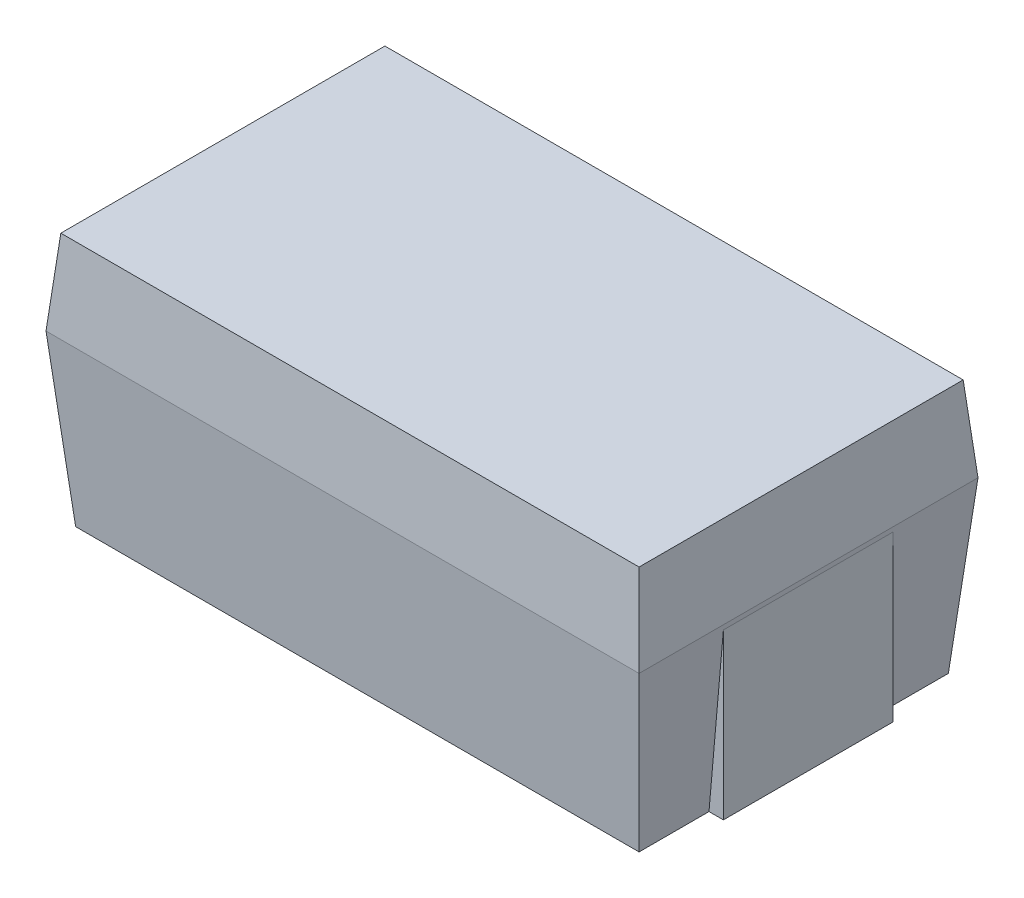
ISO-10303-21;
HEADER;
FILE_DESCRIPTION(('STEP AP214'),'2;1');
FILE_NAME('part.step','',(''),(''),'','','');
FILE_SCHEMA(('AUTOMOTIVE_DESIGN { 1 0 10303 214 1 1 1 1 }'));
ENDSEC;
DATA;
#1=APPLICATION_CONTEXT('core data for automotive mechanical design processes');
#2=APPLICATION_PROTOCOL_DEFINITION('international standard','automotive_design',2000,#1);
#3=PRODUCT_CONTEXT('',#1,'mechanical');
#4=PRODUCT('Part','Part','',(#3));
#5=PRODUCT_RELATED_PRODUCT_CATEGORY('part','',(#4));
#6=PRODUCT_DEFINITION_FORMATION('','',#4);
#7=PRODUCT_DEFINITION_CONTEXT('part definition',#1,'design');
#8=PRODUCT_DEFINITION('design','',#6,#7);
#9=PRODUCT_DEFINITION_SHAPE('','',#8);
#10=(LENGTH_UNIT() NAMED_UNIT(*) SI_UNIT(.MILLI.,.METRE.));
#11=(NAMED_UNIT(*) PLANE_ANGLE_UNIT() SI_UNIT($,.RADIAN.));
#12=(NAMED_UNIT(*) SI_UNIT($,.STERADIAN.) SOLID_ANGLE_UNIT());
#13=UNCERTAINTY_MEASURE_WITH_UNIT(LENGTH_MEASURE(1.E-05),#10,'distance_accuracy_value','');
#14=(GEOMETRIC_REPRESENTATION_CONTEXT(3) GLOBAL_UNCERTAINTY_ASSIGNED_CONTEXT((#13)) GLOBAL_UNIT_ASSIGNED_CONTEXT((#10,
#11,#12)) REPRESENTATION_CONTEXT('',''));
#15=CARTESIAN_POINT('',(0.,0.,0.));
#16=DIRECTION('',(0.,0.,1.));
#17=DIRECTION('',(1.,0.,0.));
#18=AXIS2_PLACEMENT_3D('',#15,#16,#17);
#19=CARTESIAN_POINT('',(-31.27,2.,-21.6847606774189));
#20=DIRECTION('',(0.,0.,1.));
#21=DIRECTION('',(1.,0.,0.));
#22=AXIS2_PLACEMENT_3D('',#19,#20,#21);
#23=PLANE('',#22);
#24=DIRECTION('',(1.,0.,0.));
#25=VECTOR('',#24,1.);
#26=CARTESIAN_POINT('',(-31.27,0.,-21.6847606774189));
#27=LINE('',#26,#25);
#28=CARTESIAN_POINT('',(-31.77,0.,-21.6847606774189));
#29=VERTEX_POINT('',#28);
#30=CARTESIAN_POINT('',(-31.5899130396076,0.,-21.6847606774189));
#31=VERTEX_POINT('',#30);
#32=EDGE_CURVE('E125',#29,#31,#27,.T.);
#33=ORIENTED_EDGE('',*,*,#32,.F.);
#34=DIRECTION('',(0.,1.,0.));
#35=VECTOR('',#34,1.);
#36=CARTESIAN_POINT('',(-31.77,0.,-21.6847606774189));
#37=LINE('',#36,#35);
#38=CARTESIAN_POINT('',(-31.77,2.,-21.6847606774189));
#39=VERTEX_POINT('',#38);
#40=EDGE_CURVE('E121',#39,#29,#37,.F.);
#41=ORIENTED_EDGE('',*,*,#40,.F.);
#42=DIRECTION('',(1.,0.,0.));
#43=VECTOR('',#42,1.);
#44=CARTESIAN_POINT('',(-31.27,2.,-21.6847606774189));
#45=LINE('',#44,#43);
#46=CARTESIAN_POINT('',(-31.7648903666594,2.,-21.6847606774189));
#47=VERTEX_POINT('',#46);
#48=EDGE_CURVE('E21',#47,#39,#45,.F.);
#49=ORIENTED_EDGE('',*,*,#48,.F.);
#50=DIRECTION('',(-0.0871557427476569,0.996194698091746,0.));
#51=VECTOR('',#50,1.);
#52=CARTESIAN_POINT('',(-31.7648903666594,2.00000000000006,-21.6847606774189));
#53=LINE('',#52,#51);
#54=EDGE_CURVE('E118',#47,#31,#53,.F.);
#55=ORIENTED_EDGE('',*,*,#54,.T.);
#56=EDGE_LOOP('',(#33,#41,#49,#55));
#57=FACE_BOUND('',#56,.T.);
#58=ADVANCED_FACE('F18',(#57),#23,.F.);
#59=CARTESIAN_POINT('',(-31.27,2.,-19.6847606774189));
#60=DIRECTION('',(0.,0.,-1.));
#61=DIRECTION('',(-1.,0.,0.));
#62=AXIS2_PLACEMENT_3D('',#59,#60,#61);
#63=PLANE('',#62);
#64=DIRECTION('',(-1.,0.,0.));
#65=VECTOR('',#64,1.);
#66=CARTESIAN_POINT('',(-31.27,2.,-19.6847606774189));
#67=LINE('',#66,#65);
#68=CARTESIAN_POINT('',(-31.77,2.,-19.6847606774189));
#69=VERTEX_POINT('',#68);
#70=CARTESIAN_POINT('',(-31.7648903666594,2.,-19.6847606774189));
#71=VERTEX_POINT('',#70);
#72=EDGE_CURVE('E129',#69,#71,#67,.F.);
#73=ORIENTED_EDGE('',*,*,#72,.F.);
#74=DIRECTION('',(0.,1.,0.));
#75=VECTOR('',#74,1.);
#76=CARTESIAN_POINT('',(-31.77,0.,-19.6847606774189));
#77=LINE('',#76,#75);
#78=CARTESIAN_POINT('',(-31.77,0.,-19.6847606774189));
#79=VERTEX_POINT('',#78);
#80=EDGE_CURVE('E150',#79,#69,#77,.T.);
#81=ORIENTED_EDGE('',*,*,#80,.F.);
#82=DIRECTION('',(1.,0.,0.));
#83=VECTOR('',#82,1.);
#84=CARTESIAN_POINT('',(0.,0.,-19.6847606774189));
#85=LINE('',#84,#83);
#86=CARTESIAN_POINT('',(-31.5899130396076,0.,-19.6847606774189));
#87=VERTEX_POINT('',#86);
#88=EDGE_CURVE('E179',#79,#87,#85,.T.);
#89=ORIENTED_EDGE('',*,*,#88,.T.);
#90=DIRECTION('',(-0.0871557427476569,0.996194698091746,0.));
#91=VECTOR('',#90,1.);
#92=CARTESIAN_POINT('',(-31.7648903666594,2.00000000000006,-19.6847606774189));
#93=LINE('',#92,#91);
#94=EDGE_CURVE('E171',#87,#71,#93,.T.);
#95=ORIENTED_EDGE('',*,*,#94,.T.);
#96=EDGE_LOOP('',(#73,#81,#89,#95));
#97=FACE_BOUND('',#96,.T.);
#98=ADVANCED_FACE('F380',(#97),#63,.F.);
#99=CARTESIAN_POINT('',(-31.77,0.,0.));
#100=DIRECTION('',(-1.,0.,0.));
#101=DIRECTION('',(0.,0.,1.));
#102=AXIS2_PLACEMENT_3D('',#99,#100,#101);
#103=PLANE('',#102);
#104=ORIENTED_EDGE('',*,*,#40,.T.);
#105=DIRECTION('',(0.,0.,1.));
#106=VECTOR('',#105,1.);
#107=CARTESIAN_POINT('',(-31.77,0.,0.));
#108=LINE('',#107,#106);
#109=EDGE_CURVE('E162',#29,#79,#108,.T.);
#110=ORIENTED_EDGE('',*,*,#109,.T.);
#111=ORIENTED_EDGE('',*,*,#80,.T.);
#112=DIRECTION('',(0.,0.,-1.));
#113=VECTOR('',#112,1.);
#114=CARTESIAN_POINT('',(-31.77,2.,-19.6847606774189));
#115=LINE('',#114,#113);
#116=EDGE_CURVE('E165',#69,#39,#115,.T.);
#117=ORIENTED_EDGE('',*,*,#116,.T.);
#118=EDGE_LOOP('',(#104,#110,#111,#117));
#119=FACE_BOUND('',#118,.T.);
#120=ADVANCED_FACE('F164',(#119),#103,.T.);
#121=CARTESIAN_POINT('',(-31.7648903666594,2.00000000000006,-22.6847606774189));
#122=DIRECTION('',(0.996194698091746,0.0871557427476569,0.));
#123=DIRECTION('',(-0.0871557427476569,0.996194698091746,0.));
#124=AXIS2_PLACEMENT_3D('',#121,#122,#123);
#125=PLANE('',#124);
#126=ORIENTED_EDGE('',*,*,#54,.F.);
#127=DIRECTION('',(0.,0.,1.));
#128=VECTOR('',#127,1.);
#129=CARTESIAN_POINT('',(-31.7648903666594,2.,-22.6847606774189));
#130=LINE('',#129,#128);
#131=CARTESIAN_POINT('',(-31.7648903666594,2.,-22.6847606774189));
#132=VERTEX_POINT('',#131);
#133=EDGE_CURVE('E140',#132,#47,#130,.T.);
#134=ORIENTED_EDGE('',*,*,#133,.F.);
#135=DIRECTION('',(0.0868265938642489,-0.992432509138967,0.0868265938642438));
#136=VECTOR('',#135,1.);
#137=CARTESIAN_POINT('',(-31.7648903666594,2.,-22.6847606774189));
#138=LINE('',#137,#136);
#139=CARTESIAN_POINT('',(-31.5899130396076,0.,-22.5097833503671));
#140=VERTEX_POINT('',#139);
#141=EDGE_CURVE('E166',#132,#140,#138,.T.);
#142=ORIENTED_EDGE('',*,*,#141,.T.);
#143=DIRECTION('',(0.,0.,1.));
#144=VECTOR('',#143,1.);
#145=CARTESIAN_POINT('',(-31.5899130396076,0.,0.));
#146=LINE('',#145,#144);
#147=EDGE_CURVE('E142',#140,#31,#146,.T.);
#148=ORIENTED_EDGE('',*,*,#147,.T.);
#149=EDGE_LOOP('',(#126,#134,#142,#148));
#150=FACE_BOUND('',#149,.T.);
#151=ADVANCED_FACE('F138',(#150),#125,.F.);
#152=CARTESIAN_POINT('',(-25.27,2.,-21.6847606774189));
#153=DIRECTION('',(0.,0.,-1.));
#154=DIRECTION('',(-1.,0.,0.));
#155=AXIS2_PLACEMENT_3D('',#152,#153,#154);
#156=PLANE('',#155);
#157=DIRECTION('',(-0.0871557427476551,-0.996194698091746,0.));
#158=VECTOR('',#157,1.);
#159=CARTESIAN_POINT('',(-24.7648903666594,2.00000000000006,-21.6847606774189));
#160=LINE('',#159,#158);
#161=CARTESIAN_POINT('',(-24.9398676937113,0.,-21.6847606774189));
#162=VERTEX_POINT('',#161);
#163=CARTESIAN_POINT('',(-24.77,1.9415966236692,-21.6847606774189));
#164=VERTEX_POINT('',#163);
#165=EDGE_CURVE('E195',#162,#164,#160,.F.);
#166=ORIENTED_EDGE('',*,*,#165,.T.);
#167=DIRECTION('',(0.,1.,0.));
#168=VECTOR('',#167,1.);
#169=CARTESIAN_POINT('',(-24.77,0.,-21.6847606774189));
#170=LINE('',#169,#168);
#171=CARTESIAN_POINT('',(-24.77,0.,-21.6847606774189));
#172=VERTEX_POINT('',#171);
#173=EDGE_CURVE('E143',#164,#172,#170,.F.);
#174=ORIENTED_EDGE('',*,*,#173,.T.);
#175=DIRECTION('',(1.,0.,0.));
#176=VECTOR('',#175,1.);
#177=CARTESIAN_POINT('',(0.,0.,-21.6847606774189));
#178=LINE('',#177,#176);
#179=EDGE_CURVE('E183',#172,#162,#178,.F.);
#180=ORIENTED_EDGE('',*,*,#179,.T.);
#181=EDGE_LOOP('',(#166,#174,#180));
#182=FACE_BOUND('',#181,.T.);
#183=ADVANCED_FACE('F193',(#182),#156,.T.);
#184=CARTESIAN_POINT('',(-24.77,0.,0.));
#185=DIRECTION('',(-1.,0.,0.));
#186=DIRECTION('',(0.,0.,1.));
#187=AXIS2_PLACEMENT_3D('',#184,#185,#186);
#188=PLANE('',#187);
#189=DIRECTION('',(0.,1.,0.));
#190=VECTOR('',#189,1.);
#191=CARTESIAN_POINT('',(-24.77,2.,-19.6847606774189));
#192=LINE('',#191,#190);
#193=CARTESIAN_POINT('',(-24.77,0.,-19.6847606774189));
#194=VERTEX_POINT('',#193);
#195=CARTESIAN_POINT('',(-24.77,1.94159662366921,-19.6847606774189));
#196=VERTEX_POINT('',#195);
#197=EDGE_CURVE('E110',#194,#196,#192,.T.);
#198=ORIENTED_EDGE('',*,*,#197,.F.);
#199=DIRECTION('',(0.,0.,1.));
#200=VECTOR('',#199,1.);
#201=CARTESIAN_POINT('',(-24.77,0.,0.));
#202=LINE('',#201,#200);
#203=EDGE_CURVE('E185',#194,#172,#202,.F.);
#204=ORIENTED_EDGE('',*,*,#203,.T.);
#205=ORIENTED_EDGE('',*,*,#173,.F.);
#206=DIRECTION('',(0.,0.,1.));
#207=VECTOR('',#206,1.);
#208=CARTESIAN_POINT('',(-24.77,1.9415966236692,-22.6847606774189));
#209=LINE('',#208,#207);
#210=EDGE_CURVE('E453',#164,#196,#209,.T.);
#211=ORIENTED_EDGE('',*,*,#210,.T.);
#212=EDGE_LOOP('',(#198,#204,#205,#211));
#213=FACE_BOUND('',#212,.T.);
#214=ADVANCED_FACE('F200',(#213),#188,.F.);
#215=CARTESIAN_POINT('',(-25.27,2.,-19.6847606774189));
#216=DIRECTION('',(0.,0.,1.));
#217=DIRECTION('',(1.,0.,0.));
#218=AXIS2_PLACEMENT_3D('',#215,#216,#217);
#219=PLANE('',#218);
#220=DIRECTION('',(-0.0871557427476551,-0.996194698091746,0.));
#221=VECTOR('',#220,1.);
#222=CARTESIAN_POINT('',(-24.7648903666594,2.00000000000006,-19.6847606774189));
#223=LINE('',#222,#221);
#224=CARTESIAN_POINT('',(-24.9398676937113,0.,-19.6847606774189));
#225=VERTEX_POINT('',#224);
#226=EDGE_CURVE('E449',#196,#225,#223,.T.);
#227=ORIENTED_EDGE('',*,*,#226,.T.);
#228=DIRECTION('',(1.,0.,0.));
#229=VECTOR('',#228,1.);
#230=CARTESIAN_POINT('',(0.,0.,-19.6847606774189));
#231=LINE('',#230,#229);
#232=EDGE_CURVE('E187',#225,#194,#231,.T.);
#233=ORIENTED_EDGE('',*,*,#232,.T.);
#234=ORIENTED_EDGE('',*,*,#197,.T.);
#235=EDGE_LOOP('',(#227,#233,#234));
#236=FACE_BOUND('',#235,.T.);
#237=ADVANCED_FACE('F202',(#236),#219,.T.);
#238=CARTESIAN_POINT('',(0.,0.,0.));
#239=DIRECTION('',(0.,1.,0.));
#240=DIRECTION('',(0.,0.,1.));
#241=AXIS2_PLACEMENT_3D('',#238,#239,#240);
#242=PLANE('',#241);
#243=ORIENTED_EDGE('',*,*,#88,.F.);
#244=ORIENTED_EDGE('',*,*,#109,.F.);
#245=ORIENTED_EDGE('',*,*,#32,.T.);
#246=ORIENTED_EDGE('',*,*,#147,.F.);
#247=DIRECTION('',(1.,0.,0.));
#248=VECTOR('',#247,1.);
#249=CARTESIAN_POINT('',(-31.7648903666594,0.,-22.5097833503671));
#250=LINE('',#249,#248);
#251=CARTESIAN_POINT('',(-24.9398676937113,0.,-22.5097833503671));
#252=VERTEX_POINT('',#251);
#253=EDGE_CURVE('E169',#140,#252,#250,.T.);
#254=ORIENTED_EDGE('',*,*,#253,.T.);
#255=DIRECTION('',(0.,0.,1.));
#256=VECTOR('',#255,1.);
#257=CARTESIAN_POINT('',(-24.9398676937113,0.,-22.6847606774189));
#258=LINE('',#257,#256);
#259=EDGE_CURVE('E199',#252,#162,#258,.T.);
#260=ORIENTED_EDGE('',*,*,#259,.T.);
#261=ORIENTED_EDGE('',*,*,#179,.F.);
#262=ORIENTED_EDGE('',*,*,#203,.F.);
#263=ORIENTED_EDGE('',*,*,#232,.F.);
#264=DIRECTION('',(0.,0.,1.));
#265=VECTOR('',#264,1.);
#266=CARTESIAN_POINT('',(-24.9398676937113,0.,-22.6847606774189));
#267=LINE('',#266,#265);
#268=CARTESIAN_POINT('',(-24.9398676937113,0.,-18.8597380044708));
#269=VERTEX_POINT('',#268);
#270=EDGE_CURVE('E446',#225,#269,#267,.T.);
#271=ORIENTED_EDGE('',*,*,#270,.T.);
#272=DIRECTION('',(1.,0.,0.));
#273=VECTOR('',#272,1.);
#274=CARTESIAN_POINT('',(-31.7648903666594,0.,-18.8597380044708));
#275=LINE('',#274,#273);
#276=CARTESIAN_POINT('',(-31.5899130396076,0.,-18.8597380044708));
#277=VERTEX_POINT('',#276);
#278=EDGE_CURVE('E444',#269,#277,#275,.F.);
#279=ORIENTED_EDGE('',*,*,#278,.T.);
#280=DIRECTION('',(0.,0.,1.));
#281=VECTOR('',#280,1.);
#282=CARTESIAN_POINT('',(-31.5899130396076,0.,-22.6847606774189));
#283=LINE('',#282,#281);
#284=EDGE_CURVE('E176',#277,#87,#283,.F.);
#285=ORIENTED_EDGE('',*,*,#284,.T.);
#286=EDGE_LOOP('',(#243,#244,#245,#246,#254,#260,#261,#262,#263,#271,#279,#285));
#287=FACE_BOUND('',#286,.T.);
#288=ADVANCED_FACE('F159',(#287),#242,.F.);
#289=CARTESIAN_POINT('',(-31.7648903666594,2.00000000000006,-22.6847606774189));
#290=DIRECTION('',(0.996194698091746,0.0871557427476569,0.));
#291=DIRECTION('',(-0.0871557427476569,0.996194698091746,0.));
#292=AXIS2_PLACEMENT_3D('',#289,#290,#291);
#293=PLANE('',#292);
#294=ORIENTED_EDGE('',*,*,#94,.F.);
#295=ORIENTED_EDGE('',*,*,#284,.F.);
#296=DIRECTION('',(-0.0868265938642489,0.992432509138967,0.0868265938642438));
#297=VECTOR('',#296,1.);
#298=CARTESIAN_POINT('',(-31.5899130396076,0.,-18.8597380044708));
#299=LINE('',#298,#297);
#300=CARTESIAN_POINT('',(-31.7648903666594,2.,-18.6847606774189));
#301=VERTEX_POINT('',#300);
#302=EDGE_CURVE('E448',#277,#301,#299,.T.);
#303=ORIENTED_EDGE('',*,*,#302,.T.);
#304=DIRECTION('',(0.,0.,1.));
#305=VECTOR('',#304,1.);
#306=CARTESIAN_POINT('',(-31.7648903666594,2.,-22.6847606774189));
#307=LINE('',#306,#305);
#308=EDGE_CURVE('E167',#71,#301,#307,.T.);
#309=ORIENTED_EDGE('',*,*,#308,.F.);
#310=EDGE_LOOP('',(#294,#295,#303,#309));
#311=FACE_BOUND('',#310,.T.);
#312=ADVANCED_FACE('F247',(#311),#293,.F.);
#313=CARTESIAN_POINT('',(-31.27,2.,-19.6847606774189));
#314=DIRECTION('',(0.,-1.,0.));
#315=DIRECTION('',(0.,0.,-1.));
#316=AXIS2_PLACEMENT_3D('',#313,#314,#315);
#317=PLANE('',#316);
#318=ORIENTED_EDGE('',*,*,#48,.T.);
#319=ORIENTED_EDGE('',*,*,#116,.F.);
#320=ORIENTED_EDGE('',*,*,#72,.T.);
#321=DIRECTION('',(0.,0.,1.));
#322=VECTOR('',#321,1.);
#323=CARTESIAN_POINT('',(-31.7648903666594,2.,0.));
#324=LINE('',#323,#322);
#325=EDGE_CURVE('E127',#71,#47,#324,.F.);
#326=ORIENTED_EDGE('',*,*,#325,.T.);
#327=EDGE_LOOP('',(#318,#319,#320,#326));
#328=FACE_BOUND('',#327,.T.);
#329=ADVANCED_FACE('F128',(#328),#317,.F.);
#330=CARTESIAN_POINT('',(-31.7648903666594,2.00000000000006,-22.6847606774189));
#331=DIRECTION('',(0.,0.0871557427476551,0.996194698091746));
#332=DIRECTION('',(0.,-0.996194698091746,0.0871557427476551));
#333=AXIS2_PLACEMENT_3D('',#330,#331,#332);
#334=PLANE('',#333);
#335=ORIENTED_EDGE('',*,*,#253,.F.);
#336=ORIENTED_EDGE('',*,*,#141,.F.);
#337=DIRECTION('',(1.,0.,0.));
#338=VECTOR('',#337,1.);
#339=CARTESIAN_POINT('',(0.,2.,-22.6847606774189));
#340=LINE('',#339,#338);
#341=CARTESIAN_POINT('',(-24.7648903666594,2.,-22.6847606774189));
#342=VERTEX_POINT('',#341);
#343=EDGE_CURVE('E134',#132,#342,#340,.T.);
#344=ORIENTED_EDGE('',*,*,#343,.T.);
#345=DIRECTION('',(-0.0868265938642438,-0.992432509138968,0.0868265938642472));
#346=VECTOR('',#345,1.);
#347=CARTESIAN_POINT('',(-24.7648903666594,2.,-22.6847606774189));
#348=LINE('',#347,#346);
#349=EDGE_CURVE('E460',#342,#252,#348,.T.);
#350=ORIENTED_EDGE('',*,*,#349,.T.);
#351=EDGE_LOOP('',(#335,#336,#344,#350));
#352=FACE_BOUND('',#351,.T.);
#353=ADVANCED_FACE('F240',(#352),#334,.F.);
#354=CARTESIAN_POINT('',(-24.7648903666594,2.00000000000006,-22.6847606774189));
#355=DIRECTION('',(-0.996194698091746,0.0871557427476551,0.));
#356=DIRECTION('',(-0.0871557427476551,-0.996194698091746,0.));
#357=AXIS2_PLACEMENT_3D('',#354,#355,#356);
#358=PLANE('',#357);
#359=ORIENTED_EDGE('',*,*,#210,.F.);
#360=ORIENTED_EDGE('',*,*,#165,.F.);
#361=ORIENTED_EDGE('',*,*,#259,.F.);
#362=ORIENTED_EDGE('',*,*,#349,.F.);
#363=DIRECTION('',(0.,0.,1.));
#364=VECTOR('',#363,1.);
#365=CARTESIAN_POINT('',(-24.7648903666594,2.,0.));
#366=LINE('',#365,#364);
#367=CARTESIAN_POINT('',(-24.7648903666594,2.,-18.6847606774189));
#368=VERTEX_POINT('',#367);
#369=EDGE_CURVE('E469',#342,#368,#366,.T.);
#370=ORIENTED_EDGE('',*,*,#369,.T.);
#371=DIRECTION('',(-0.0868265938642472,-0.992432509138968,-0.0868265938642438));
#372=VECTOR('',#371,1.);
#373=CARTESIAN_POINT('',(-24.7648903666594,2.,-18.6847606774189));
#374=LINE('',#373,#372);
#375=EDGE_CURVE('E135',#368,#269,#374,.T.);
#376=ORIENTED_EDGE('',*,*,#375,.T.);
#377=ORIENTED_EDGE('',*,*,#270,.F.);
#378=ORIENTED_EDGE('',*,*,#226,.F.);
#379=EDGE_LOOP('',(#359,#360,#361,#362,#370,#376,#377,#378));
#380=FACE_BOUND('',#379,.T.);
#381=ADVANCED_FACE('F236',(#380),#358,.F.);
#382=CARTESIAN_POINT('',(-31.7648903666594,2.00000000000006,-18.6847606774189));
#383=DIRECTION('',(0.,0.0871557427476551,-0.996194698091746));
#384=DIRECTION('',(0.,0.996194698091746,0.0871557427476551));
#385=AXIS2_PLACEMENT_3D('',#382,#383,#384);
#386=PLANE('',#385);
#387=DIRECTION('',(1.,0.,0.));
#388=VECTOR('',#387,1.);
#389=CARTESIAN_POINT('',(0.,2.,-18.6847606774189));
#390=LINE('',#389,#388);
#391=EDGE_CURVE('E481',#368,#301,#390,.F.);
#392=ORIENTED_EDGE('',*,*,#391,.T.);
#393=ORIENTED_EDGE('',*,*,#302,.F.);
#394=ORIENTED_EDGE('',*,*,#278,.F.);
#395=ORIENTED_EDGE('',*,*,#375,.F.);
#396=EDGE_LOOP('',(#392,#393,#394,#395));
#397=FACE_BOUND('',#396,.T.);
#398=ADVANCED_FACE('F233',(#397),#386,.F.);
#399=CARTESIAN_POINT('',(-31.6774017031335,3.,0.));
#400=DIRECTION('',(0.996194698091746,-0.0871557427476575,0.));
#401=DIRECTION('',(0.0871557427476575,0.996194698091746,0.));
#402=AXIS2_PLACEMENT_3D('',#399,#400,#401);
#403=PLANE('',#402);
#404=ORIENTED_EDGE('',*,*,#133,.T.);
#405=ORIENTED_EDGE('',*,*,#325,.F.);
#406=ORIENTED_EDGE('',*,*,#308,.T.);
#407=DIRECTION('',(0.086826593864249,0.992432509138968,-0.0868265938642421));
#408=VECTOR('',#407,1.);
#409=CARTESIAN_POINT('',(-31.7648903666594,2.,-18.6847606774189));
#410=LINE('',#409,#408);
#411=CARTESIAN_POINT('',(-31.6774017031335,3.,-18.7722493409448));
#412=VERTEX_POINT('',#411);
#413=EDGE_CURVE('E483',#301,#412,#410,.T.);
#414=ORIENTED_EDGE('',*,*,#413,.T.);
#415=DIRECTION('',(0.,0.,-1.));
#416=VECTOR('',#415,1.);
#417=CARTESIAN_POINT('',(-31.6774017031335,3.,0.));
#418=LINE('',#417,#416);
#419=CARTESIAN_POINT('',(-31.6774017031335,3.,-22.597272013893));
#420=VERTEX_POINT('',#419);
#421=EDGE_CURVE('E486',#412,#420,#418,.T.);
#422=ORIENTED_EDGE('',*,*,#421,.T.);
#423=DIRECTION('',(-0.086826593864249,-0.992432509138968,-0.0868265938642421));
#424=VECTOR('',#423,1.);
#425=CARTESIAN_POINT('',(-31.6774017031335,3.,-22.597272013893));
#426=LINE('',#425,#424);
#427=EDGE_CURVE('E148',#420,#132,#426,.T.);
#428=ORIENTED_EDGE('',*,*,#427,.T.);
#429=EDGE_LOOP('',(#404,#405,#406,#414,#422,#428));
#430=FACE_BOUND('',#429,.T.);
#431=ADVANCED_FACE('F146',(#430),#403,.F.);
#432=CARTESIAN_POINT('',(0.,3.,-22.597272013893));
#433=DIRECTION('',(0.,-0.087155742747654,0.996194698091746));
#434=DIRECTION('',(0.,-0.996194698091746,-0.087155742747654));
#435=AXIS2_PLACEMENT_3D('',#432,#433,#434);
#436=PLANE('',#435);
#437=DIRECTION('',(1.,0.,0.));
#438=VECTOR('',#437,1.);
#439=CARTESIAN_POINT('',(0.,3.,-22.597272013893));
#440=LINE('',#439,#438);
#441=CARTESIAN_POINT('',(-24.8523790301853,3.,-22.597272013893));
#442=VERTEX_POINT('',#441);
#443=EDGE_CURVE('E475',#420,#442,#440,.T.);
#444=ORIENTED_EDGE('',*,*,#443,.T.);
#445=DIRECTION('',(0.0868265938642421,-0.992432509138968,-0.0868265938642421));
#446=VECTOR('',#445,1.);
#447=CARTESIAN_POINT('',(-24.8523790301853,3.,-22.597272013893));
#448=LINE('',#447,#446);
#449=EDGE_CURVE('E471',#442,#342,#448,.T.);
#450=ORIENTED_EDGE('',*,*,#449,.T.);
#451=ORIENTED_EDGE('',*,*,#343,.F.);
#452=ORIENTED_EDGE('',*,*,#427,.F.);
#453=EDGE_LOOP('',(#444,#450,#451,#452));
#454=FACE_BOUND('',#453,.T.);
#455=ADVANCED_FACE('F226',(#454),#436,.F.);
#456=CARTESIAN_POINT('',(-24.8523790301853,3.,0.));
#457=DIRECTION('',(-0.996194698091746,-0.087155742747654,0.));
#458=DIRECTION('',(0.087155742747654,-0.996194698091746,0.));
#459=AXIS2_PLACEMENT_3D('',#456,#457,#458);
#460=PLANE('',#459);
#461=ORIENTED_EDGE('',*,*,#369,.F.);
#462=ORIENTED_EDGE('',*,*,#449,.F.);
#463=DIRECTION('',(0.,0.,-1.));
#464=VECTOR('',#463,1.);
#465=CARTESIAN_POINT('',(-24.8523790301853,3.,0.));
#466=LINE('',#465,#464);
#467=CARTESIAN_POINT('',(-24.8523790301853,3.,-18.7722493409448));
#468=VERTEX_POINT('',#467);
#469=EDGE_CURVE('E27',#442,#468,#466,.F.);
#470=ORIENTED_EDGE('',*,*,#469,.T.);
#471=DIRECTION('',(0.0868265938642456,-0.992432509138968,0.0868265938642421));
#472=VECTOR('',#471,1.);
#473=CARTESIAN_POINT('',(-24.8523790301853,3.,-18.7722493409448));
#474=LINE('',#473,#472);
#475=EDGE_CURVE('E35',#468,#368,#474,.T.);
#476=ORIENTED_EDGE('',*,*,#475,.T.);
#477=EDGE_LOOP('',(#461,#462,#470,#476));
#478=FACE_BOUND('',#477,.T.);
#479=ADVANCED_FACE('F220',(#478),#460,.F.);
#480=CARTESIAN_POINT('',(0.,3.,-18.7722493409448));
#481=DIRECTION('',(0.,-0.087155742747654,-0.996194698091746));
#482=DIRECTION('',(0.,0.996194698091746,-0.087155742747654));
#483=AXIS2_PLACEMENT_3D('',#480,#481,#482);
#484=PLANE('',#483);
#485=ORIENTED_EDGE('',*,*,#391,.F.);
#486=ORIENTED_EDGE('',*,*,#475,.F.);
#487=DIRECTION('',(1.,0.,0.));
#488=VECTOR('',#487,1.);
#489=CARTESIAN_POINT('',(0.,3.,-18.7722493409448));
#490=LINE('',#489,#488);
#491=EDGE_CURVE('E11',#468,#412,#490,.F.);
#492=ORIENTED_EDGE('',*,*,#491,.T.);
#493=ORIENTED_EDGE('',*,*,#413,.F.);
#494=EDGE_LOOP('',(#485,#486,#492,#493));
#495=FACE_BOUND('',#494,.T.);
#496=ADVANCED_FACE('F214',(#495),#484,.F.);
#497=CARTESIAN_POINT('',(0.,3.,0.));
#498=DIRECTION('',(0.,-1.,0.));
#499=DIRECTION('',(0.,0.,-1.));
#500=AXIS2_PLACEMENT_3D('',#497,#498,#499);
#501=PLANE('',#500);
#502=ORIENTED_EDGE('',*,*,#469,.F.);
#503=ORIENTED_EDGE('',*,*,#443,.F.);
#504=ORIENTED_EDGE('',*,*,#421,.F.);
#505=ORIENTED_EDGE('',*,*,#491,.F.);
#506=EDGE_LOOP('',(#502,#503,#504,#505));
#507=FACE_BOUND('',#506,.T.);
#508=ADVANCED_FACE('F212',(#507),#501,.F.);
#509=CLOSED_SHELL('',(#58,#98,#120,#151,#183,#214,#237,#288,#312,#329,#353,#381,#398,#431,#455,
#479,#496,#508));
#510=MANIFOLD_SOLID_BREP('B1',#509);
#511=ADVANCED_BREP_SHAPE_REPRESENTATION('',(#18,#510),#14);
#512=SHAPE_DEFINITION_REPRESENTATION(#9,#511);
ENDSEC;
END-ISO-10303-21;
